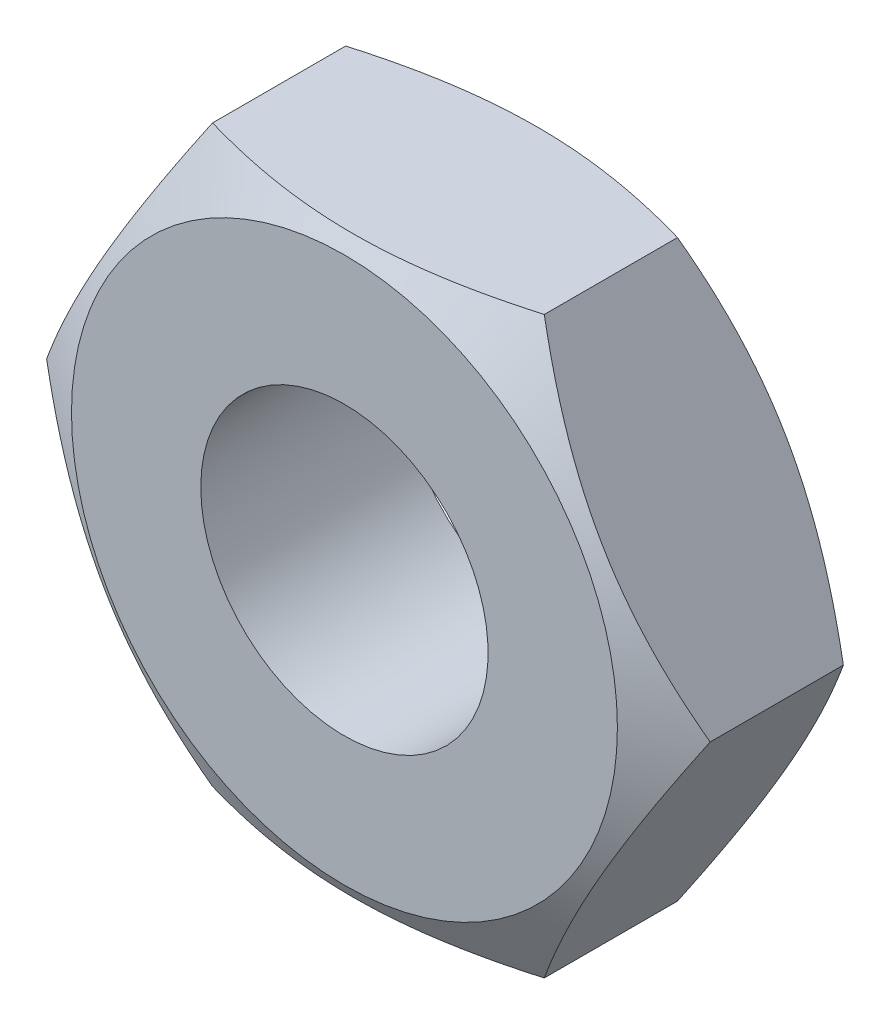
ISO-10303-21;
HEADER;
FILE_DESCRIPTION(('STEP AP214'),'2;1');
FILE_NAME('part.step','',(''),(''),'','','');
FILE_SCHEMA(('AUTOMOTIVE_DESIGN { 1 0 10303 214 1 1 1 1 }'));
ENDSEC;
DATA;
#1=APPLICATION_CONTEXT('core data for automotive mechanical design processes');
#2=APPLICATION_PROTOCOL_DEFINITION('international standard','automotive_design',2000,#1);
#3=PRODUCT_CONTEXT('',#1,'mechanical');
#4=PRODUCT('Part','Part','',(#3));
#5=PRODUCT_RELATED_PRODUCT_CATEGORY('part','',(#4));
#6=PRODUCT_DEFINITION_FORMATION('','',#4);
#7=PRODUCT_DEFINITION_CONTEXT('part definition',#1,'design');
#8=PRODUCT_DEFINITION('design','',#6,#7);
#9=PRODUCT_DEFINITION_SHAPE('','',#8);
#10=(LENGTH_UNIT() NAMED_UNIT(*) SI_UNIT(.MILLI.,.METRE.));
#11=(NAMED_UNIT(*) PLANE_ANGLE_UNIT() SI_UNIT($,.RADIAN.));
#12=(NAMED_UNIT(*) SI_UNIT($,.STERADIAN.) SOLID_ANGLE_UNIT());
#13=UNCERTAINTY_MEASURE_WITH_UNIT(LENGTH_MEASURE(1.E-05),#10,'distance_accuracy_value','');
#14=(GEOMETRIC_REPRESENTATION_CONTEXT(3) GLOBAL_UNCERTAINTY_ASSIGNED_CONTEXT((#13)) GLOBAL_UNIT_ASSIGNED_CONTEXT((#10,
#11,#12)) REPRESENTATION_CONTEXT('',''));
#15=CARTESIAN_POINT('',(0.,0.,0.));
#16=DIRECTION('',(0.,0.,1.));
#17=DIRECTION('',(1.,0.,0.));
#18=AXIS2_PLACEMENT_3D('',#15,#16,#17);
#19=CARTESIAN_POINT('',(-2.88675134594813,-5.,3.5));
#20=DIRECTION('',(-0.866025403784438,-0.500000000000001,0.));
#21=DIRECTION('',(0.500000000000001,-0.866025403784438,0.));
#22=AXIS2_PLACEMENT_3D('',#19,#20,#21);
#23=PLANE('',#22);
#24=DIRECTION('',(0.,0.,-1.));
#25=VECTOR('',#24,1.);
#26=CARTESIAN_POINT('',(-2.88675134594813,-5.,3.5));
#27=LINE('',#26,#25);
#28=CARTESIAN_POINT('',(-2.88675134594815,-5.,2.90908044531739));
#29=VERTEX_POINT('',#28);
#30=CARTESIAN_POINT('',(-2.88675134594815,-5.,0.590919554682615));
#31=VERTEX_POINT('',#30);
#32=EDGE_CURVE('E11',#29,#31,#27,.T.);
#33=ORIENTED_EDGE('',*,*,#32,.F.);
#34=CARTESIAN_POINT('',(-2.8866358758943,-5.0002,2.90901377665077));
#35=CARTESIAN_POINT('',(-3.01349970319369,-4.78046540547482,2.98227586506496));
#36=CARTESIAN_POINT('',(-3.1414485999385,-4.55885141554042,3.04891111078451));
#37=CARTESIAN_POINT('',(-3.39956193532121,-4.11178600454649,3.16522344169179));
#38=CARTESIAN_POINT('',(-3.52973095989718,-3.88632664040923,3.21485938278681));
#39=CARTESIAN_POINT('',(-3.78847564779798,-3.43816769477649,3.2921114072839));
#40=CARTESIAN_POINT('',(-3.91701101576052,-3.21553790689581,3.3202420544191));
#41=CARTESIAN_POINT('',(-4.11026620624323,-2.88081009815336,3.34546751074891));
#42=CARTESIAN_POINT('',(-4.17472868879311,-2.76915780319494,3.35104897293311));
#43=CARTESIAN_POINT('',(-4.30371322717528,-2.54575002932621,3.35646021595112));
#44=CARTESIAN_POINT('',(-4.3682352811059,-2.43399455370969,3.35629017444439));
#45=CARTESIAN_POINT('',(-4.54500768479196,-2.12781576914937,3.34790880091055));
#46=CARTESIAN_POINT('',(-4.65719946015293,-1.93349391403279,3.33383266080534));
#47=CARTESIAN_POINT('',(-4.88083840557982,-1.5461398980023,3.28919717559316));
#48=CARTESIAN_POINT('',(-4.99228478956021,-1.35310909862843,3.25862257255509));
#49=CARTESIAN_POINT('',(-5.21637431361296,-0.96497465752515,3.18219393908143));
#50=CARTESIAN_POINT('',(-5.32898917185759,-0.769920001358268,3.13601605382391));
#51=CARTESIAN_POINT('',(-5.55253939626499,-0.382719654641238,3.03121063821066));
#52=CARTESIAN_POINT('',(-5.66347762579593,-0.190569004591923,2.97260772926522));
#53=CARTESIAN_POINT('',(-5.77361816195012,0.0001999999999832,2.90901377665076));
#54=B_SPLINE_CURVE_WITH_KNOTS('',3,(#34,#35,#36,#37,#38,#39,#40,#41,#42,#43,#44,#45,#46,#47,#48,
#49,#50,#51,#52,#53),.UNSPECIFIED.,.F.,.F.,(4,2,2,2,2,2,2,2,2,4),(0.,0.792555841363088,
1.58701660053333,2.3618153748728,2.74884076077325,3.13585419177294,3.80962362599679,
4.48401723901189,5.17336882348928,5.86136694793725),.UNSPECIFIED.);
#55=CARTESIAN_POINT('',(-5.77350269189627,0.,2.90908044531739));
#56=VERTEX_POINT('',#55);
#57=EDGE_CURVE('E88',#29,#56,#54,.T.);
#58=ORIENTED_EDGE('',*,*,#57,.T.);
#59=DIRECTION('',(0.,0.,-1.));
#60=VECTOR('',#59,1.);
#61=CARTESIAN_POINT('',(-5.77350269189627,0.,3.5));
#62=LINE('',#61,#60);
#63=CARTESIAN_POINT('',(-5.77350269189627,0.,0.590919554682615));
#64=VERTEX_POINT('',#63);
#65=EDGE_CURVE('E37',#56,#64,#62,.T.);
#66=ORIENTED_EDGE('',*,*,#65,.T.);
#67=CARTESIAN_POINT('',(-5.77361816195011,0.000199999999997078,0.590986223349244));
#68=CARTESIAN_POINT('',(-5.64675433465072,-0.219534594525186,0.517724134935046));
#69=CARTESIAN_POINT('',(-5.51880543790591,-0.44114858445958,0.451088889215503));
#70=CARTESIAN_POINT('',(-5.26069210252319,-0.888213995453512,0.334776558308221));
#71=CARTESIAN_POINT('',(-5.13052307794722,-1.11367335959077,0.2851406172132));
#72=CARTESIAN_POINT('',(-4.87177839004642,-1.56183230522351,0.207888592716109));
#73=CARTESIAN_POINT('',(-4.74324302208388,-1.78446209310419,0.179757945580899));
#74=CARTESIAN_POINT('',(-4.54998783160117,-2.11918990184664,0.154532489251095));
#75=CARTESIAN_POINT('',(-4.48552534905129,-2.23084219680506,0.148951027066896));
#76=CARTESIAN_POINT('',(-4.35654081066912,-2.4542499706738,0.143539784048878));
#77=CARTESIAN_POINT('',(-4.29201875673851,-2.56600544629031,0.143709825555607));
#78=CARTESIAN_POINT('',(-4.11524635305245,-2.87218423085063,0.152091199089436));
#79=CARTESIAN_POINT('',(-4.00305457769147,-3.06650608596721,0.166167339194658));
#80=CARTESIAN_POINT('',(-3.77941563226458,-3.4538601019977,0.210802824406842));
#81=CARTESIAN_POINT('',(-3.66796924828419,-3.64689090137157,0.241377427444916));
#82=CARTESIAN_POINT('',(-3.44387972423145,-4.03502534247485,0.317806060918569));
#83=CARTESIAN_POINT('',(-3.33126486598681,-4.23007999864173,0.363983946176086));
#84=CARTESIAN_POINT('',(-3.10771464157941,-4.61728034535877,0.468789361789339));
#85=CARTESIAN_POINT('',(-2.99677641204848,-4.80943099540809,0.527392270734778));
#86=CARTESIAN_POINT('',(-2.8866358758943,-5.0002,0.59098622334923));
#87=B_SPLINE_CURVE_WITH_KNOTS('',3,(#67,#68,#69,#70,#71,#72,#73,#74,#75,#76,#77,#78,#79,#80,#81,
#82,#83,#84,#85,#86),.UNSPECIFIED.,.F.,.F.,(4,2,2,2,2,2,2,2,2,4),(0.,0.792555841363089,
1.58701660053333,2.3618153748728,2.74884076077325,3.13585419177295,3.80962362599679,
4.48401723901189,5.17336882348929,5.86136694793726),.UNSPECIFIED.);
#88=EDGE_CURVE('E103',#64,#31,#87,.T.);
#89=ORIENTED_EDGE('',*,*,#88,.T.);
#90=EDGE_LOOP('',(#33,#58,#66,#89));
#91=FACE_BOUND('',#90,.T.);
#92=ADVANCED_FACE('F33',(#91),#23,.T.);
#93=CARTESIAN_POINT('',(2.88675134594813,-5.,3.5));
#94=DIRECTION('',(0.,-1.,0.));
#95=DIRECTION('',(0.,0.,-1.));
#96=AXIS2_PLACEMENT_3D('',#93,#94,#95);
#97=PLANE('',#96);
#98=DIRECTION('',(0.,0.,-1.));
#99=VECTOR('',#98,1.);
#100=CARTESIAN_POINT('',(2.88675134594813,-5.,3.5));
#101=LINE('',#100,#99);
#102=CARTESIAN_POINT('',(2.88675134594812,-5.00000000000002,2.90908044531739));
#103=VERTEX_POINT('',#102);
#104=CARTESIAN_POINT('',(2.88675134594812,-5.00000000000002,0.590919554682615));
#105=VERTEX_POINT('',#104);
#106=EDGE_CURVE('E42',#103,#105,#101,.T.);
#107=ORIENTED_EDGE('',*,*,#106,.F.);
#108=CARTESIAN_POINT('',(-7.63608831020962,-5.,0.97269384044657));
#109=CARTESIAN_POINT('',(-7.41671502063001,-5.,1.07862390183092));
#110=CARTESIAN_POINT('',(-7.19682078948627,-5.,1.18349478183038));
#111=CARTESIAN_POINT('',(-6.75570867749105,-5.,1.39051245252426));
#112=CARTESIAN_POINT('',(-6.53449057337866,-5.,1.49265876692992));
#113=CARTESIAN_POINT('',(-6.08924401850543,-5.,1.69416407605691));
#114=CARTESIAN_POINT('',(-5.86520671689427,-5.,1.79350358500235));
#115=CARTESIAN_POINT('',(-5.41528330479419,-5.,1.98788681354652));
#116=CARTESIAN_POINT('',(-5.18939729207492,-5.,2.08293075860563));
#117=CARTESIAN_POINT('',(-4.7327063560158,-5.,2.26866995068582));
#118=CARTESIAN_POINT('',(-4.5018748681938,-5.,2.35930024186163));
#119=CARTESIAN_POINT('',(-4.03748213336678,-5.,2.53341259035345));
#120=CARTESIAN_POINT('',(-3.80392058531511,-5.,2.61689385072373));
#121=CARTESIAN_POINT('',(-3.33418257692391,-5.,2.77445039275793));
#122=CARTESIAN_POINT('',(-3.09801295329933,-5.,2.84854584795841));
#123=CARTESIAN_POINT('',(-2.622317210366,-5.,2.98491149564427));
#124=CARTESIAN_POINT('',(-2.38279218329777,-5.,3.04718544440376));
#125=CARTESIAN_POINT('',(-1.90021405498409,-5.,3.1568740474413));
#126=CARTESIAN_POINT('',(-1.6571597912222,-5.,3.20428368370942));
#127=CARTESIAN_POINT('',(-1.16814339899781,-5.,3.28103450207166));
#128=CARTESIAN_POINT('',(-0.922181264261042,-5.,3.31037564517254));
#129=CARTESIAN_POINT('',(-0.430179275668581,-5.,3.34839332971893));
#130=CARTESIAN_POINT('',(-0.184149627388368,-5.,3.35719859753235));
#131=CARTESIAN_POINT('',(0.307704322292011,-5.,3.3536856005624));
#132=CARTESIAN_POINT('',(0.553528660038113,-5.,3.3413727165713));
#133=CARTESIAN_POINT('',(0.973839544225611,-5.,3.30312768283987));
#134=CARTESIAN_POINT('',(1.14879180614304,-5.,3.28204654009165));
#135=CARTESIAN_POINT('',(1.49733080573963,-5.,3.23056856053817));
#136=CARTESIAN_POINT('',(1.67091733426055,-5.,3.20017032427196));
#137=CARTESIAN_POINT('',(2.18990458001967,-5.,3.09651358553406));
#138=CARTESIAN_POINT('',(2.53285316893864,-5.,3.01086277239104));
#139=CARTESIAN_POINT('',(3.04581132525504,-5.,2.86334580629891));
#140=CARTESIAN_POINT('',(3.21850342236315,-5.,2.81028496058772));
#141=CARTESIAN_POINT('',(3.56221900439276,-5.,2.69891367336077));
#142=CARTESIAN_POINT('',(3.73324233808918,-5.,2.64060276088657));
#143=CARTESIAN_POINT('',(4.07276682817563,-5.,2.51997787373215));
#144=CARTESIAN_POINT('',(4.24127677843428,-5.,2.45768840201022));
#145=CARTESIAN_POINT('',(4.57686542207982,-5.,2.32952844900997));
#146=CARTESIAN_POINT('',(4.7439445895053,-5.,2.26365921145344));
#147=CARTESIAN_POINT('',(4.91042173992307,-5.,2.19633577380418));
#148=B_SPLINE_CURVE_WITH_KNOTS('',3,(#108,#109,#110,#111,#112,#113,#114,#115,#116,#117,#118,
#119,#120,#121,#122,#123,#124,#125,#126,#127,#128,#129,#130,#131,#132,#133,#134,#135,#136,#137,
#138,#139,#140,#141,#142,#143,#144,#145,#146,#147),.UNSPECIFIED.,.F.,.F.,(4,2,2,2,2,2,2,2,2,2,2,
2,2,2,2,2,2,2,2,4),(0.,0.730839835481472,1.46180660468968,2.19699145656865,2.93213767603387,
3.67600400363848,4.4199531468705,5.16227511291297,5.90436081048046,6.64669675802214,
7.38903430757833,8.12670595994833,8.8641896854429,9.39258492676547,9.92105957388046,
10.9800497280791,11.5219872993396,12.0639735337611,12.602894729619,13.1416298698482),.UNSPECIFIED.);
#149=EDGE_CURVE('E96',#103,#29,#148,.F.);
#150=ORIENTED_EDGE('',*,*,#149,.T.);
#151=ORIENTED_EDGE('',*,*,#32,.T.);
#152=CARTESIAN_POINT('',(-7.63608831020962,-5.,2.52730615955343));
#153=CARTESIAN_POINT('',(-7.41671502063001,-5.,2.42137609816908));
#154=CARTESIAN_POINT('',(-7.19682078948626,-5.,2.31650521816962));
#155=CARTESIAN_POINT('',(-6.75570867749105,-5.,2.10948754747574));
#156=CARTESIAN_POINT('',(-6.53449057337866,-5.,2.00734123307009));
#157=CARTESIAN_POINT('',(-6.08924401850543,-5.,1.80583592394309));
#158=CARTESIAN_POINT('',(-5.86520671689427,-5.,1.70649641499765));
#159=CARTESIAN_POINT('',(-5.41528330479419,-5.,1.51211318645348));
#160=CARTESIAN_POINT('',(-5.18939729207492,-5.,1.41706924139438));
#161=CARTESIAN_POINT('',(-4.73270635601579,-5.,1.23133004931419));
#162=CARTESIAN_POINT('',(-4.5018748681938,-5.,1.14069975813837));
#163=CARTESIAN_POINT('',(-4.03748213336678,-5.,0.966587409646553));
#164=CARTESIAN_POINT('',(-3.80392058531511,-5.,0.88310614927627));
#165=CARTESIAN_POINT('',(-3.33418257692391,-5.,0.725549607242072));
#166=CARTESIAN_POINT('',(-3.09801295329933,-5.,0.65145415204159));
#167=CARTESIAN_POINT('',(-2.622317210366,-5.,0.515088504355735));
#168=CARTESIAN_POINT('',(-2.38279218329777,-5.,0.452814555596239));
#169=CARTESIAN_POINT('',(-1.90021405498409,-5.,0.343125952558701));
#170=CARTESIAN_POINT('',(-1.6571597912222,-5.,0.295716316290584));
#171=CARTESIAN_POINT('',(-1.16814339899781,-5.,0.218965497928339));
#172=CARTESIAN_POINT('',(-0.922181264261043,-5.,0.18962435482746));
#173=CARTESIAN_POINT('',(-0.430179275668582,-5.,0.151606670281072));
#174=CARTESIAN_POINT('',(-0.184149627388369,-5.,0.142801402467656));
#175=CARTESIAN_POINT('',(0.30770432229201,-5.,0.146314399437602));
#176=CARTESIAN_POINT('',(0.553528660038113,-5.,0.1586272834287));
#177=CARTESIAN_POINT('',(0.973839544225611,-5.,0.196872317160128));
#178=CARTESIAN_POINT('',(1.14879180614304,-5.,0.217953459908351));
#179=CARTESIAN_POINT('',(1.49733080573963,-5.,0.269431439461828));
#180=CARTESIAN_POINT('',(1.67091733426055,-5.,0.299829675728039));
#181=CARTESIAN_POINT('',(2.18990458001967,-5.,0.403486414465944));
#182=CARTESIAN_POINT('',(2.53285316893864,-5.,0.48913722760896));
#183=CARTESIAN_POINT('',(3.04581132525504,-5.,0.636654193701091));
#184=CARTESIAN_POINT('',(3.21850342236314,-5.,0.68971503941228));
#185=CARTESIAN_POINT('',(3.56221900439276,-5.,0.801086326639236));
#186=CARTESIAN_POINT('',(3.73324233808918,-5.,0.859397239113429));
#187=CARTESIAN_POINT('',(4.07276682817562,-5.,0.980022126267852));
#188=CARTESIAN_POINT('',(4.24127677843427,-5.,1.04231159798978));
#189=CARTESIAN_POINT('',(4.57686542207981,-5.,1.17047155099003));
#190=CARTESIAN_POINT('',(4.7439445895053,-5.,1.23634078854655));
#191=CARTESIAN_POINT('',(4.91042173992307,-5.,1.30366422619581));
#192=B_SPLINE_CURVE_WITH_KNOTS('',3,(#152,#153,#154,#155,#156,#157,#158,#159,#160,#161,#162,
#163,#164,#165,#166,#167,#168,#169,#170,#171,#172,#173,#174,#175,#176,#177,#178,#179,#180,#181,
#182,#183,#184,#185,#186,#187,#188,#189,#190,#191),.UNSPECIFIED.,.F.,.F.,(4,2,2,2,2,2,2,2,2,2,2,
2,2,2,2,2,2,2,2,4),(0.,0.730839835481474,1.46180660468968,2.19699145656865,2.93213767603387,
3.67600400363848,4.4199531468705,5.16227511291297,5.90436081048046,6.64669675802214,
7.38903430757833,8.12670595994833,8.8641896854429,9.39258492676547,9.92105957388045,
10.9800497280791,11.5219872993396,12.0639735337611,12.602894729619,13.1416298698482),.UNSPECIFIED.);
#193=EDGE_CURVE('E105',#31,#105,#192,.T.);
#194=ORIENTED_EDGE('',*,*,#193,.T.);
#195=EDGE_LOOP('',(#107,#150,#151,#194));
#196=FACE_BOUND('',#195,.T.);
#197=ADVANCED_FACE('F161',(#196),#97,.T.);
#198=CARTESIAN_POINT('',(5.77350269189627,0.,3.5));
#199=DIRECTION('',(0.866025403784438,-0.500000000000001,0.));
#200=DIRECTION('',(0.500000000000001,0.866025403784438,0.));
#201=AXIS2_PLACEMENT_3D('',#198,#199,#200);
#202=PLANE('',#201);
#203=DIRECTION('',(0.,0.,-1.));
#204=VECTOR('',#203,1.);
#205=CARTESIAN_POINT('',(5.77350269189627,0.,3.5));
#206=LINE('',#205,#204);
#207=CARTESIAN_POINT('',(5.77350269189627,0.,2.90908044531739));
#208=VERTEX_POINT('',#207);
#209=CARTESIAN_POINT('',(5.77350269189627,0.,0.590919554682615));
#210=VERTEX_POINT('',#209);
#211=EDGE_CURVE('E197',#208,#210,#206,.T.);
#212=ORIENTED_EDGE('',*,*,#211,.F.);
#213=CARTESIAN_POINT('',(5.77361816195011,0.000200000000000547,2.90901377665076));
#214=CARTESIAN_POINT('',(5.64675433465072,-0.219534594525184,2.98227586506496));
#215=CARTESIAN_POINT('',(5.51880543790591,-0.441148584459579,3.0489111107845));
#216=CARTESIAN_POINT('',(5.26069210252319,-0.888213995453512,3.16522344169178));
#217=CARTESIAN_POINT('',(5.13052307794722,-1.11367335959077,3.2148593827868));
#218=CARTESIAN_POINT('',(4.87177839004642,-1.56183230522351,3.29211140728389));
#219=CARTESIAN_POINT('',(4.74324302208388,-1.78446209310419,3.3202420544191));
#220=CARTESIAN_POINT('',(4.54998783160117,-2.11918990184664,3.34546751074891));
#221=CARTESIAN_POINT('',(4.48552534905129,-2.23084219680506,3.35104897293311));
#222=CARTESIAN_POINT('',(4.35654081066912,-2.4542499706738,3.35646021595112));
#223=CARTESIAN_POINT('',(4.29201875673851,-2.56600544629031,3.35629017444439));
#224=CARTESIAN_POINT('',(4.11524635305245,-2.87218423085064,3.34790880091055));
#225=CARTESIAN_POINT('',(4.00305457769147,-3.06650608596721,3.33383266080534));
#226=CARTESIAN_POINT('',(3.77941563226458,-3.45386010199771,3.28919717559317));
#227=CARTESIAN_POINT('',(3.66796924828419,-3.64689090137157,3.25862257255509));
#228=CARTESIAN_POINT('',(3.44387972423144,-4.03502534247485,3.18219393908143));
#229=CARTESIAN_POINT('',(3.3312648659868,-4.23007999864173,3.13601605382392));
#230=CARTESIAN_POINT('',(3.10771464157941,-4.61728034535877,3.03121063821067));
#231=CARTESIAN_POINT('',(2.99677641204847,-4.80943099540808,2.97260772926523));
#232=CARTESIAN_POINT('',(2.8866358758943,-5.0002,2.90901377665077));
#233=B_SPLINE_CURVE_WITH_KNOTS('',3,(#213,#214,#215,#216,#217,#218,#219,#220,#221,#222,#223,
#224,#225,#226,#227,#228,#229,#230,#231,#232),.UNSPECIFIED.,.F.,.F.,(4,2,2,2,2,2,2,2,2,4),(0.,
0.792555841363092,1.58701660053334,2.36181537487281,2.74884076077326,3.13585419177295,
3.8096236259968,4.4840172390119,5.17336882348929,5.86136694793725),.UNSPECIFIED.);
#234=EDGE_CURVE('E167',#208,#103,#233,.T.);
#235=ORIENTED_EDGE('',*,*,#234,.T.);
#236=ORIENTED_EDGE('',*,*,#106,.T.);
#237=CARTESIAN_POINT('',(2.8866358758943,-5.0002,0.59098622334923));
#238=CARTESIAN_POINT('',(3.01349970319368,-4.78046540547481,0.517724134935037));
#239=CARTESIAN_POINT('',(3.14144859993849,-4.55885141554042,0.451088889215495));
#240=CARTESIAN_POINT('',(3.39956193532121,-4.11178600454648,0.334776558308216));
#241=CARTESIAN_POINT('',(3.52973095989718,-3.88632664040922,0.285140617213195));
#242=CARTESIAN_POINT('',(3.78847564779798,-3.43816769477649,0.207888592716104));
#243=CARTESIAN_POINT('',(3.91701101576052,-3.21553790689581,0.179757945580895));
#244=CARTESIAN_POINT('',(4.11026620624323,-2.88081009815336,0.154532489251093));
#245=CARTESIAN_POINT('',(4.17472868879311,-2.76915780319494,0.148951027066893));
#246=CARTESIAN_POINT('',(4.30371322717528,-2.5457500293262,0.143539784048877));
#247=CARTESIAN_POINT('',(4.36823528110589,-2.43399455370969,0.143709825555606));
#248=CARTESIAN_POINT('',(4.54500768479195,-2.12781576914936,0.152091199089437));
#249=CARTESIAN_POINT('',(4.65719946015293,-1.93349391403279,0.166167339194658));
#250=CARTESIAN_POINT('',(4.88083840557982,-1.5461398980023,0.210802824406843));
#251=CARTESIAN_POINT('',(4.99228478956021,-1.35310909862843,0.241377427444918));
#252=CARTESIAN_POINT('',(5.21637431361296,-0.964974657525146,0.317806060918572));
#253=CARTESIAN_POINT('',(5.3289891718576,-0.769920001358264,0.363983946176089));
#254=CARTESIAN_POINT('',(5.55253939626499,-0.382719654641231,0.468789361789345));
#255=CARTESIAN_POINT('',(5.66347762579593,-0.190569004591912,0.527392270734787));
#256=CARTESIAN_POINT('',(5.77361816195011,0.000200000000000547,0.590986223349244));
#257=B_SPLINE_CURVE_WITH_KNOTS('',3,(#237,#238,#239,#240,#241,#242,#243,#244,#245,#246,#247,
#248,#249,#250,#251,#252,#253,#254,#255,#256),.UNSPECIFIED.,.F.,.F.,(4,2,2,2,2,2,2,2,2,4),(0.,
0.792555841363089,1.58701660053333,2.3618153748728,2.74884076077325,3.13585419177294,
3.80962362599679,4.48401723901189,5.17336882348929,5.86136694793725),.UNSPECIFIED.);
#258=EDGE_CURVE('E108',#105,#210,#257,.T.);
#259=ORIENTED_EDGE('',*,*,#258,.T.);
#260=EDGE_LOOP('',(#212,#235,#236,#259));
#261=FACE_BOUND('',#260,.T.);
#262=ADVANCED_FACE('F157',(#261),#202,.T.);
#263=CARTESIAN_POINT('',(2.88675134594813,5.,3.5));
#264=DIRECTION('',(0.866025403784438,0.500000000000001,0.));
#265=DIRECTION('',(-0.500000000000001,0.866025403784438,0.));
#266=AXIS2_PLACEMENT_3D('',#263,#264,#265);
#267=PLANE('',#266);
#268=DIRECTION('',(0.,0.,-1.));
#269=VECTOR('',#268,1.);
#270=CARTESIAN_POINT('',(2.88675134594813,5.,3.5));
#271=LINE('',#270,#269);
#272=CARTESIAN_POINT('',(2.88675134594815,5.,2.90908044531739));
#273=VERTEX_POINT('',#272);
#274=CARTESIAN_POINT('',(2.88675134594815,5.,0.590919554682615));
#275=VERTEX_POINT('',#274);
#276=EDGE_CURVE('E104',#273,#275,#271,.T.);
#277=ORIENTED_EDGE('',*,*,#276,.F.);
#278=CARTESIAN_POINT('',(2.8866358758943,5.0002,2.90901377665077));
#279=CARTESIAN_POINT('',(3.01349970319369,4.78046540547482,2.98227586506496));
#280=CARTESIAN_POINT('',(3.1414485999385,4.55885141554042,3.04891111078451));
#281=CARTESIAN_POINT('',(3.39956193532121,4.11178600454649,3.16522344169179));
#282=CARTESIAN_POINT('',(3.52973095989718,3.88632664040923,3.21485938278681));
#283=CARTESIAN_POINT('',(3.78847564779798,3.43816769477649,3.2921114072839));
#284=CARTESIAN_POINT('',(3.91701101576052,3.21553790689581,3.3202420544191));
#285=CARTESIAN_POINT('',(4.11026620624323,2.88081009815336,3.34546751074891));
#286=CARTESIAN_POINT('',(4.17472868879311,2.76915780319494,3.35104897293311));
#287=CARTESIAN_POINT('',(4.30371322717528,2.54575002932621,3.35646021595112));
#288=CARTESIAN_POINT('',(4.36823528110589,2.43399455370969,3.35629017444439));
#289=CARTESIAN_POINT('',(4.54500768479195,2.12781576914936,3.34790880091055));
#290=CARTESIAN_POINT('',(4.65719946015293,1.93349391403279,3.33383266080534));
#291=CARTESIAN_POINT('',(4.88083840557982,1.5461398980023,3.28919717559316));
#292=CARTESIAN_POINT('',(4.99228478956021,1.35310909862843,3.25862257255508));
#293=CARTESIAN_POINT('',(5.21637431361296,0.964974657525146,3.18219393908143));
#294=CARTESIAN_POINT('',(5.3289891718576,0.769920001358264,3.13601605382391));
#295=CARTESIAN_POINT('',(5.552539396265,0.382719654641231,3.03121063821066));
#296=CARTESIAN_POINT('',(5.66347762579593,0.190569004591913,2.97260772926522));
#297=CARTESIAN_POINT('',(5.77361816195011,-0.000200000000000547,2.90901377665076));
#298=B_SPLINE_CURVE_WITH_KNOTS('',3,(#278,#279,#280,#281,#282,#283,#284,#285,#286,#287,#288,
#289,#290,#291,#292,#293,#294,#295,#296,#297),.UNSPECIFIED.,.F.,.F.,(4,2,2,2,2,2,2,2,2,4),(0.,
0.792555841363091,1.58701660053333,2.3618153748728,2.74884076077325,3.13585419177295,
3.80962362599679,4.48401723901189,5.17336882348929,5.86136694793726),.UNSPECIFIED.);
#299=EDGE_CURVE('E174',#273,#208,#298,.T.);
#300=ORIENTED_EDGE('',*,*,#299,.T.);
#301=ORIENTED_EDGE('',*,*,#211,.T.);
#302=CARTESIAN_POINT('',(5.77361816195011,-0.000200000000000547,0.590986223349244));
#303=CARTESIAN_POINT('',(5.64675433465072,0.219534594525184,0.517724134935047));
#304=CARTESIAN_POINT('',(5.51880543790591,0.441148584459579,0.451088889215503));
#305=CARTESIAN_POINT('',(5.26069210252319,0.888213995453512,0.334776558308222));
#306=CARTESIAN_POINT('',(5.13052307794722,1.11367335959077,0.2851406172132));
#307=CARTESIAN_POINT('',(4.87177839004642,1.56183230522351,0.207888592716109));
#308=CARTESIAN_POINT('',(4.74324302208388,1.78446209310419,0.179757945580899));
#309=CARTESIAN_POINT('',(4.54998783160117,2.11918990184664,0.154532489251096));
#310=CARTESIAN_POINT('',(4.48552534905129,2.23084219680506,0.148951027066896));
#311=CARTESIAN_POINT('',(4.35654081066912,2.4542499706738,0.143539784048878));
#312=CARTESIAN_POINT('',(4.29201875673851,2.56600544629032,0.143709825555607));
#313=CARTESIAN_POINT('',(4.11524635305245,2.87218423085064,0.152091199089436));
#314=CARTESIAN_POINT('',(4.00305457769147,3.06650608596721,0.166167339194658));
#315=CARTESIAN_POINT('',(3.77941563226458,3.45386010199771,0.210802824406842));
#316=CARTESIAN_POINT('',(3.66796924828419,3.64689090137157,0.241377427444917));
#317=CARTESIAN_POINT('',(3.44387972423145,4.03502534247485,0.31780606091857));
#318=CARTESIAN_POINT('',(3.33126486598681,4.23007999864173,0.363983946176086));
#319=CARTESIAN_POINT('',(3.10771464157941,4.61728034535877,0.468789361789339));
#320=CARTESIAN_POINT('',(2.99677641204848,4.80943099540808,0.527392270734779));
#321=CARTESIAN_POINT('',(2.8866358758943,5.0002,0.59098622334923));
#322=B_SPLINE_CURVE_WITH_KNOTS('',3,(#302,#303,#304,#305,#306,#307,#308,#309,#310,#311,#312,
#313,#314,#315,#316,#317,#318,#319,#320,#321),.UNSPECIFIED.,.F.,.F.,(4,2,2,2,2,2,2,2,2,4),(0.,
0.792555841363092,1.58701660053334,2.36181537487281,2.74884076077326,3.13585419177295,
3.8096236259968,4.4840172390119,5.17336882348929,5.86136694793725),.UNSPECIFIED.);
#323=EDGE_CURVE('E147',#210,#275,#322,.T.);
#324=ORIENTED_EDGE('',*,*,#323,.T.);
#325=EDGE_LOOP('',(#277,#300,#301,#324));
#326=FACE_BOUND('',#325,.T.);
#327=ADVANCED_FACE('F160',(#326),#267,.T.);
#328=CARTESIAN_POINT('',(-2.88675134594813,5.,3.5));
#329=DIRECTION('',(0.,1.,0.));
#330=DIRECTION('',(0.,0.,1.));
#331=AXIS2_PLACEMENT_3D('',#328,#329,#330);
#332=PLANE('',#331);
#333=DIRECTION('',(0.,0.,-1.));
#334=VECTOR('',#333,1.);
#335=CARTESIAN_POINT('',(-2.88675134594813,5.,3.5));
#336=LINE('',#335,#334);
#337=CARTESIAN_POINT('',(-2.88675134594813,5.,2.9090804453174));
#338=VERTEX_POINT('',#337);
#339=CARTESIAN_POINT('',(-2.88675134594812,5.00000000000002,0.590919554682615));
#340=VERTEX_POINT('',#339);
#341=EDGE_CURVE('E102',#338,#340,#336,.T.);
#342=ORIENTED_EDGE('',*,*,#341,.F.);
#343=CARTESIAN_POINT('',(-7.63608831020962,5.,0.97269384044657));
#344=CARTESIAN_POINT('',(-7.41671502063,5.,1.07862390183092));
#345=CARTESIAN_POINT('',(-7.19682078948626,5.,1.18349478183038));
#346=CARTESIAN_POINT('',(-6.75570867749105,5.,1.39051245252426));
#347=CARTESIAN_POINT('',(-6.53449057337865,5.,1.49265876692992));
#348=CARTESIAN_POINT('',(-6.08924401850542,5.,1.69416407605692));
#349=CARTESIAN_POINT('',(-5.86520671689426,5.,1.79350358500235));
#350=CARTESIAN_POINT('',(-5.41528330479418,5.,1.98788681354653));
#351=CARTESIAN_POINT('',(-5.18939729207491,5.,2.08293075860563));
#352=CARTESIAN_POINT('',(-4.73270635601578,5.,2.26866995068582));
#353=CARTESIAN_POINT('',(-4.50187486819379,5.,2.35930024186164));
#354=CARTESIAN_POINT('',(-4.03748213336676,5.,2.53341259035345));
#355=CARTESIAN_POINT('',(-3.8039205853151,5.,2.61689385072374));
#356=CARTESIAN_POINT('',(-3.3341825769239,5.,2.77445039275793));
#357=CARTESIAN_POINT('',(-3.09801295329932,4.99999999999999,2.84854584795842));
#358=CARTESIAN_POINT('',(-2.62231721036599,5.00000000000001,2.98491149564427));
#359=CARTESIAN_POINT('',(-2.38279218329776,5.00000000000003,3.04718544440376));
#360=CARTESIAN_POINT('',(-1.90021405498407,5.00000000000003,3.1568740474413));
#361=CARTESIAN_POINT('',(-1.65715979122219,5.00000000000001,3.20428368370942));
#362=CARTESIAN_POINT('',(-1.1681433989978,4.99999999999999,3.28103450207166));
#363=CARTESIAN_POINT('',(-0.922181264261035,5.,3.31037564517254));
#364=CARTESIAN_POINT('',(-0.430179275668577,5.,3.34839332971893));
#365=CARTESIAN_POINT('',(-0.184149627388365,5.,3.35719859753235));
#366=CARTESIAN_POINT('',(0.307704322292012,5.,3.3536856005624));
#367=CARTESIAN_POINT('',(0.553528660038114,5.,3.3413727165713));
#368=CARTESIAN_POINT('',(0.973839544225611,5.,3.30312768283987));
#369=CARTESIAN_POINT('',(1.14879180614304,5.,3.28204654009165));
#370=CARTESIAN_POINT('',(1.49733080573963,5.,3.23056856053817));
#371=CARTESIAN_POINT('',(1.67091733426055,5.,3.20017032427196));
#372=CARTESIAN_POINT('',(2.18990458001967,5.,3.09651358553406));
#373=CARTESIAN_POINT('',(2.53285316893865,5.,3.01086277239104));
#374=CARTESIAN_POINT('',(3.04581132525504,5.,2.86334580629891));
#375=CARTESIAN_POINT('',(3.21850342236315,5.,2.81028496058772));
#376=CARTESIAN_POINT('',(3.56221900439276,5.,2.69891367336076));
#377=CARTESIAN_POINT('',(3.73324233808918,5.,2.64060276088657));
#378=CARTESIAN_POINT('',(4.07276682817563,5.,2.51997787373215));
#379=CARTESIAN_POINT('',(4.24127677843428,5.,2.45768840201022));
#380=CARTESIAN_POINT('',(4.57686542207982,5.,2.32952844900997));
#381=CARTESIAN_POINT('',(4.7439445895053,5.,2.26365921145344));
#382=CARTESIAN_POINT('',(4.91042173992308,5.,2.19633577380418));
#383=B_SPLINE_CURVE_WITH_KNOTS('',3,(#343,#344,#345,#346,#347,#348,#349,#350,#351,#352,#353,
#354,#355,#356,#357,#358,#359,#360,#361,#362,#363,#364,#365,#366,#367,#368,#369,#370,#371,#372,
#373,#374,#375,#376,#377,#378,#379,#380,#381,#382),.UNSPECIFIED.,.F.,.F.,(4,2,2,2,2,2,2,2,2,2,2,
2,2,2,2,2,2,2,2,4),(0.,0.730839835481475,1.46180660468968,2.19699145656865,2.93213767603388,
3.67600400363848,4.41995314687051,5.16227511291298,5.90436081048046,6.64669675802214,
7.38903430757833,8.12670595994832,8.86418968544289,9.39258492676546,9.92105957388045,
10.9800497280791,11.5219872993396,12.0639735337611,12.602894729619,13.1416298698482),.UNSPECIFIED.);
#384=EDGE_CURVE('E50',#338,#273,#383,.T.);
#385=ORIENTED_EDGE('',*,*,#384,.T.);
#386=ORIENTED_EDGE('',*,*,#276,.T.);
#387=CARTESIAN_POINT('',(-7.63608831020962,5.,2.52730615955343));
#388=CARTESIAN_POINT('',(-7.41671502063,5.,2.42137609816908));
#389=CARTESIAN_POINT('',(-7.19682078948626,5.,2.31650521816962));
#390=CARTESIAN_POINT('',(-6.75570867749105,5.,2.10948754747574));
#391=CARTESIAN_POINT('',(-6.53449057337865,5.,2.00734123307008));
#392=CARTESIAN_POINT('',(-6.08924401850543,5.,1.80583592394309));
#393=CARTESIAN_POINT('',(-5.86520671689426,5.,1.70649641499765));
#394=CARTESIAN_POINT('',(-5.41528330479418,5.,1.51211318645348));
#395=CARTESIAN_POINT('',(-5.18939729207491,5.,1.41706924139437));
#396=CARTESIAN_POINT('',(-4.73270635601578,5.,1.23133004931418));
#397=CARTESIAN_POINT('',(-4.50187486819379,5.,1.14069975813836));
#398=CARTESIAN_POINT('',(-4.03748213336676,5.,0.966587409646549));
#399=CARTESIAN_POINT('',(-3.8039205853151,5.,0.883106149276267));
#400=CARTESIAN_POINT('',(-3.3341825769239,5.,0.725549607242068));
#401=CARTESIAN_POINT('',(-3.09801295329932,4.99999999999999,0.651454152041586));
#402=CARTESIAN_POINT('',(-2.62231721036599,5.00000000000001,0.515088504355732));
#403=CARTESIAN_POINT('',(-2.38279218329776,5.00000000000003,0.452814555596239));
#404=CARTESIAN_POINT('',(-1.90021405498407,5.00000000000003,0.343125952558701));
#405=CARTESIAN_POINT('',(-1.65715979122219,5.00000000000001,0.295716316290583));
#406=CARTESIAN_POINT('',(-1.1681433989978,4.99999999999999,0.218965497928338));
#407=CARTESIAN_POINT('',(-0.922181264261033,5.,0.18962435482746));
#408=CARTESIAN_POINT('',(-0.430179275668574,5.,0.151606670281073));
#409=CARTESIAN_POINT('',(-0.184149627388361,5.,0.142801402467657));
#410=CARTESIAN_POINT('',(0.307704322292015,5.,0.146314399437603));
#411=CARTESIAN_POINT('',(0.553528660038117,5.,0.1586272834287));
#412=CARTESIAN_POINT('',(0.973839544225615,5.,0.196872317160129));
#413=CARTESIAN_POINT('',(1.14879180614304,5.,0.217953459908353));
#414=CARTESIAN_POINT('',(1.49733080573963,5.,0.269431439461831));
#415=CARTESIAN_POINT('',(1.67091733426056,5.,0.299829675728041));
#416=CARTESIAN_POINT('',(2.18990458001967,5.,0.403486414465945));
#417=CARTESIAN_POINT('',(2.53285316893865,5.,0.489137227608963));
#418=CARTESIAN_POINT('',(3.04581132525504,5.,0.636654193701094));
#419=CARTESIAN_POINT('',(3.21850342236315,5.,0.689715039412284));
#420=CARTESIAN_POINT('',(3.56221900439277,5.,0.801086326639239));
#421=CARTESIAN_POINT('',(3.73324233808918,5.,0.859397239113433));
#422=CARTESIAN_POINT('',(4.07276682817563,5.,0.980022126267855));
#423=CARTESIAN_POINT('',(4.24127677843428,5.,1.04231159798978));
#424=CARTESIAN_POINT('',(4.57686542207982,5.,1.17047155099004));
#425=CARTESIAN_POINT('',(4.7439445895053,5.,1.23634078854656));
#426=CARTESIAN_POINT('',(4.91042173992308,5.,1.30366422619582));
#427=B_SPLINE_CURVE_WITH_KNOTS('',3,(#387,#388,#389,#390,#391,#392,#393,#394,#395,#396,#397,
#398,#399,#400,#401,#402,#403,#404,#405,#406,#407,#408,#409,#410,#411,#412,#413,#414,#415,#416,
#417,#418,#419,#420,#421,#422,#423,#424,#425,#426),.UNSPECIFIED.,.F.,.F.,(4,2,2,2,2,2,2,2,2,2,2,
2,2,2,2,2,2,2,2,4),(0.,0.730839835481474,1.46180660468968,2.19699145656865,2.93213767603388,
3.67600400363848,4.41995314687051,5.16227511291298,5.90436081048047,6.64669675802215,
7.38903430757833,8.12670595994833,8.8641896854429,9.39258492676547,9.92105957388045,
10.9800497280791,11.5219872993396,12.0639735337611,12.602894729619,13.1416298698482),.UNSPECIFIED.);
#428=EDGE_CURVE('E140',#275,#340,#427,.F.);
#429=ORIENTED_EDGE('',*,*,#428,.T.);
#430=EDGE_LOOP('',(#342,#385,#386,#429));
#431=FACE_BOUND('',#430,.T.);
#432=ADVANCED_FACE('F205',(#431),#332,.T.);
#433=CARTESIAN_POINT('',(-5.77350269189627,0.,3.5));
#434=DIRECTION('',(-0.866025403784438,0.500000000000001,0.));
#435=DIRECTION('',(-0.500000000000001,-0.866025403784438,0.));
#436=AXIS2_PLACEMENT_3D('',#433,#434,#435);
#437=PLANE('',#436);
#438=ORIENTED_EDGE('',*,*,#65,.F.);
#439=CARTESIAN_POINT('',(-5.77361816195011,-0.000200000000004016,2.90901377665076));
#440=CARTESIAN_POINT('',(-5.64675433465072,0.219534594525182,2.98227586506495));
#441=CARTESIAN_POINT('',(-5.51880543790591,0.441148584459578,3.0489111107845));
#442=CARTESIAN_POINT('',(-5.26069210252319,0.888213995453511,3.16522344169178));
#443=CARTESIAN_POINT('',(-5.13052307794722,1.11367335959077,3.2148593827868));
#444=CARTESIAN_POINT('',(-4.87177839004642,1.56183230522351,3.29211140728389));
#445=CARTESIAN_POINT('',(-4.74324302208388,1.78446209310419,3.3202420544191));
#446=CARTESIAN_POINT('',(-4.54998783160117,2.11918990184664,3.34546751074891));
#447=CARTESIAN_POINT('',(-4.48552534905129,2.23084219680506,3.35104897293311));
#448=CARTESIAN_POINT('',(-4.35654081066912,2.4542499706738,3.35646021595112));
#449=CARTESIAN_POINT('',(-4.29201875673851,2.56600544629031,3.35629017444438));
#450=CARTESIAN_POINT('',(-4.11524635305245,2.87218423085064,3.34790880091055));
#451=CARTESIAN_POINT('',(-4.00305457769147,3.06650608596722,3.33383266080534));
#452=CARTESIAN_POINT('',(-3.77941563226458,3.45386010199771,3.28919717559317));
#453=CARTESIAN_POINT('',(-3.66796924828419,3.64689090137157,3.25862257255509));
#454=CARTESIAN_POINT('',(-3.44387972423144,4.03502534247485,3.18219393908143));
#455=CARTESIAN_POINT('',(-3.33126486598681,4.23007999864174,3.13601605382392));
#456=CARTESIAN_POINT('',(-3.10771464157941,4.61728034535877,3.03121063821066));
#457=CARTESIAN_POINT('',(-2.99677641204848,4.80943099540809,2.97260772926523));
#458=CARTESIAN_POINT('',(-2.8866358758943,5.0002,2.90901377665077));
#459=B_SPLINE_CURVE_WITH_KNOTS('',3,(#439,#440,#441,#442,#443,#444,#445,#446,#447,#448,#449,
#450,#451,#452,#453,#454,#455,#456,#457,#458),.UNSPECIFIED.,.F.,.F.,(4,2,2,2,2,2,2,2,2,4),(0.,
0.792555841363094,1.58701660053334,2.36181537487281,2.74884076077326,3.13585419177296,
3.8096236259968,4.4840172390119,5.17336882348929,5.86136694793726),.UNSPECIFIED.);
#460=EDGE_CURVE('E85',#56,#338,#459,.T.);
#461=ORIENTED_EDGE('',*,*,#460,.T.);
#462=ORIENTED_EDGE('',*,*,#341,.T.);
#463=CARTESIAN_POINT('',(-2.8866358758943,5.0002,0.59098622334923));
#464=CARTESIAN_POINT('',(-3.01349970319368,4.78046540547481,0.517724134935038));
#465=CARTESIAN_POINT('',(-3.1414485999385,4.55885141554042,0.451088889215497));
#466=CARTESIAN_POINT('',(-3.39956193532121,4.11178600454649,0.334776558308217));
#467=CARTESIAN_POINT('',(-3.52973095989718,3.88632664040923,0.285140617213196));
#468=CARTESIAN_POINT('',(-3.78847564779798,3.43816769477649,0.207888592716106));
#469=CARTESIAN_POINT('',(-3.91701101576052,3.21553790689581,0.179757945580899));
#470=CARTESIAN_POINT('',(-4.11026620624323,2.88081009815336,0.154532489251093));
#471=CARTESIAN_POINT('',(-4.17472868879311,2.76915780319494,0.148951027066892));
#472=CARTESIAN_POINT('',(-4.30371322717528,2.54575002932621,0.143539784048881));
#473=CARTESIAN_POINT('',(-4.36823528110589,2.43399455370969,0.143709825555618));
#474=CARTESIAN_POINT('',(-4.54500768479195,2.12781576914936,0.152091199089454));
#475=CARTESIAN_POINT('',(-4.65719946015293,1.93349391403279,0.166167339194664));
#476=CARTESIAN_POINT('',(-4.88083840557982,1.5461398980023,0.21080282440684));
#477=CARTESIAN_POINT('',(-4.99228478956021,1.35310909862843,0.241377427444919));
#478=CARTESIAN_POINT('',(-5.21637431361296,0.964974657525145,0.317806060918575));
#479=CARTESIAN_POINT('',(-5.3289891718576,0.769920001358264,0.363983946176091));
#480=CARTESIAN_POINT('',(-5.552539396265,0.38271965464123,0.468789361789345));
#481=CARTESIAN_POINT('',(-5.66347762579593,0.190569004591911,0.527392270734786));
#482=CARTESIAN_POINT('',(-5.77361816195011,-0.000200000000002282,0.590986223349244));
#483=B_SPLINE_CURVE_WITH_KNOTS('',3,(#463,#464,#465,#466,#467,#468,#469,#470,#471,#472,#473,
#474,#475,#476,#477,#478,#479,#480,#481,#482),.UNSPECIFIED.,.F.,.F.,(4,2,2,2,2,2,2,2,2,4),(0.,
0.792555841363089,1.58701660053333,2.3618153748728,2.74884076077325,3.13585419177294,
3.80962362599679,4.48401723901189,5.17336882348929,5.86136694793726),.UNSPECIFIED.);
#484=EDGE_CURVE('E101',#340,#64,#483,.T.);
#485=ORIENTED_EDGE('',*,*,#484,.T.);
#486=EDGE_LOOP('',(#438,#461,#462,#485));
#487=FACE_BOUND('',#486,.T.);
#488=ADVANCED_FACE('F99',(#487),#437,.T.);
#489=CARTESIAN_POINT('',(0.,0.,0.));
#490=DIRECTION('',(0.,0.,1.));
#491=DIRECTION('',(1.,0.,0.));
#492=AXIS2_PLACEMENT_3D('',#489,#490,#491);
#493=CONICAL_SURFACE('',#492,4.75,1.0471975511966);
#494=ORIENTED_EDGE('',*,*,#484,.F.);
#495=ORIENTED_EDGE('',*,*,#428,.F.);
#496=ORIENTED_EDGE('',*,*,#323,.F.);
#497=ORIENTED_EDGE('',*,*,#258,.F.);
#498=ORIENTED_EDGE('',*,*,#193,.F.);
#499=ORIENTED_EDGE('',*,*,#88,.F.);
#500=EDGE_LOOP('',(#494,#495,#496,#497,#498,#499));
#501=FACE_BOUND('',#500,.T.);
#502=CARTESIAN_POINT('',(0.,0.,0.));
#503=DIRECTION('',(0.,0.,-1.));
#504=DIRECTION('',(-1.,0.,0.));
#505=AXIS2_PLACEMENT_3D('',#502,#503,#504);
#506=CIRCLE('',#505,4.75);
#507=CARTESIAN_POINT('',(-4.75,0.,0.));
#508=VERTEX_POINT('',#507);
#509=EDGE_CURVE('E95',#508,#508,#506,.T.);
#510=ORIENTED_EDGE('',*,*,#509,.F.);
#511=EDGE_LOOP('',(#510));
#512=FACE_BOUND('',#511,.T.);
#513=ADVANCED_FACE('F120',(#501,#512),#493,.T.);
#514=CARTESIAN_POINT('',(-5.77350269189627,0.,0.));
#515=DIRECTION('',(0.,0.,-1.));
#516=DIRECTION('',(-1.,0.,0.));
#517=AXIS2_PLACEMENT_3D('',#514,#515,#516);
#518=PLANE('',#517);
#519=CARTESIAN_POINT('',(0.,0.,0.));
#520=DIRECTION('',(0.,0.,-1.));
#521=DIRECTION('',(-1.,0.,0.));
#522=AXIS2_PLACEMENT_3D('',#519,#520,#521);
#523=CIRCLE('',#522,2.49999999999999);
#524=CARTESIAN_POINT('',(-2.49999999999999,0.,0.));
#525=VERTEX_POINT('',#524);
#526=EDGE_CURVE('E296',#525,#525,#523,.T.);
#527=ORIENTED_EDGE('',*,*,#526,.F.);
#528=EDGE_LOOP('',(#527));
#529=FACE_BOUND('',#528,.T.);
#530=ORIENTED_EDGE('',*,*,#509,.T.);
#531=EDGE_LOOP('',(#530));
#532=FACE_BOUND('',#531,.T.);
#533=ADVANCED_FACE('F125',(#529,#532),#518,.T.);
#534=CARTESIAN_POINT('',(0.,0.,3.5));
#535=DIRECTION('',(0.,0.,-1.));
#536=DIRECTION('',(1.,0.,0.));
#537=AXIS2_PLACEMENT_3D('',#534,#535,#536);
#538=CONICAL_SURFACE('',#537,4.75,1.0471975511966);
#539=ORIENTED_EDGE('',*,*,#149,.F.);
#540=ORIENTED_EDGE('',*,*,#234,.F.);
#541=ORIENTED_EDGE('',*,*,#299,.F.);
#542=ORIENTED_EDGE('',*,*,#384,.F.);
#543=ORIENTED_EDGE('',*,*,#460,.F.);
#544=ORIENTED_EDGE('',*,*,#57,.F.);
#545=EDGE_LOOP('',(#539,#540,#541,#542,#543,#544));
#546=FACE_BOUND('',#545,.T.);
#547=CARTESIAN_POINT('',(0.,0.,3.5));
#548=DIRECTION('',(0.,0.,-1.));
#549=DIRECTION('',(-1.,0.,0.));
#550=AXIS2_PLACEMENT_3D('',#547,#548,#549);
#551=CIRCLE('',#550,4.75);
#552=CARTESIAN_POINT('',(-4.75,0.,3.5));
#553=VERTEX_POINT('',#552);
#554=EDGE_CURVE('E92',#553,#553,#551,.T.);
#555=ORIENTED_EDGE('',*,*,#554,.T.);
#556=EDGE_LOOP('',(#555));
#557=FACE_BOUND('',#556,.T.);
#558=ADVANCED_FACE('F86',(#546,#557),#538,.T.);
#559=CARTESIAN_POINT('',(-5.77350269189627,0.,3.5));
#560=DIRECTION('',(0.,0.,-1.));
#561=DIRECTION('',(-1.,0.,0.));
#562=AXIS2_PLACEMENT_3D('',#559,#560,#561);
#563=PLANE('',#562);
#564=CARTESIAN_POINT('',(0.,0.,3.5));
#565=DIRECTION('',(0.,0.,-1.));
#566=DIRECTION('',(-1.,0.,0.));
#567=AXIS2_PLACEMENT_3D('',#564,#565,#566);
#568=CIRCLE('',#567,2.5);
#569=CARTESIAN_POINT('',(-2.5,0.,3.5));
#570=VERTEX_POINT('',#569);
#571=EDGE_CURVE('E293',#570,#570,#568,.T.);
#572=ORIENTED_EDGE('',*,*,#571,.T.);
#573=EDGE_LOOP('',(#572));
#574=FACE_BOUND('',#573,.T.);
#575=ORIENTED_EDGE('',*,*,#554,.F.);
#576=EDGE_LOOP('',(#575));
#577=FACE_BOUND('',#576,.T.);
#578=ADVANCED_FACE('F268',(#574,#577),#563,.F.);
#579=CARTESIAN_POINT('',(0.,0.,0.));
#580=DIRECTION('',(0.,0.,-1.));
#581=DIRECTION('',(-1.,0.,0.));
#582=AXIS2_PLACEMENT_3D('',#579,#580,#581);
#583=CYLINDRICAL_SURFACE('',#582,2.49999999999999);
#584=ORIENTED_EDGE('',*,*,#571,.F.);
#585=EDGE_LOOP('',(#584));
#586=FACE_BOUND('',#585,.T.);
#587=ORIENTED_EDGE('',*,*,#526,.T.);
#588=EDGE_LOOP('',(#587));
#589=FACE_BOUND('',#588,.T.);
#590=ADVANCED_FACE('F277',(#586,#589),#583,.F.);
#591=CLOSED_SHELL('',(#92,#197,#262,#327,#432,#488,#513,#533,#558,#578,#590));
#592=MANIFOLD_SOLID_BREP('B2',#591);
#593=ADVANCED_BREP_SHAPE_REPRESENTATION('',(#18,#592),#14);
#594=SHAPE_DEFINITION_REPRESENTATION(#9,#593);
ENDSEC;
END-ISO-10303-21;
